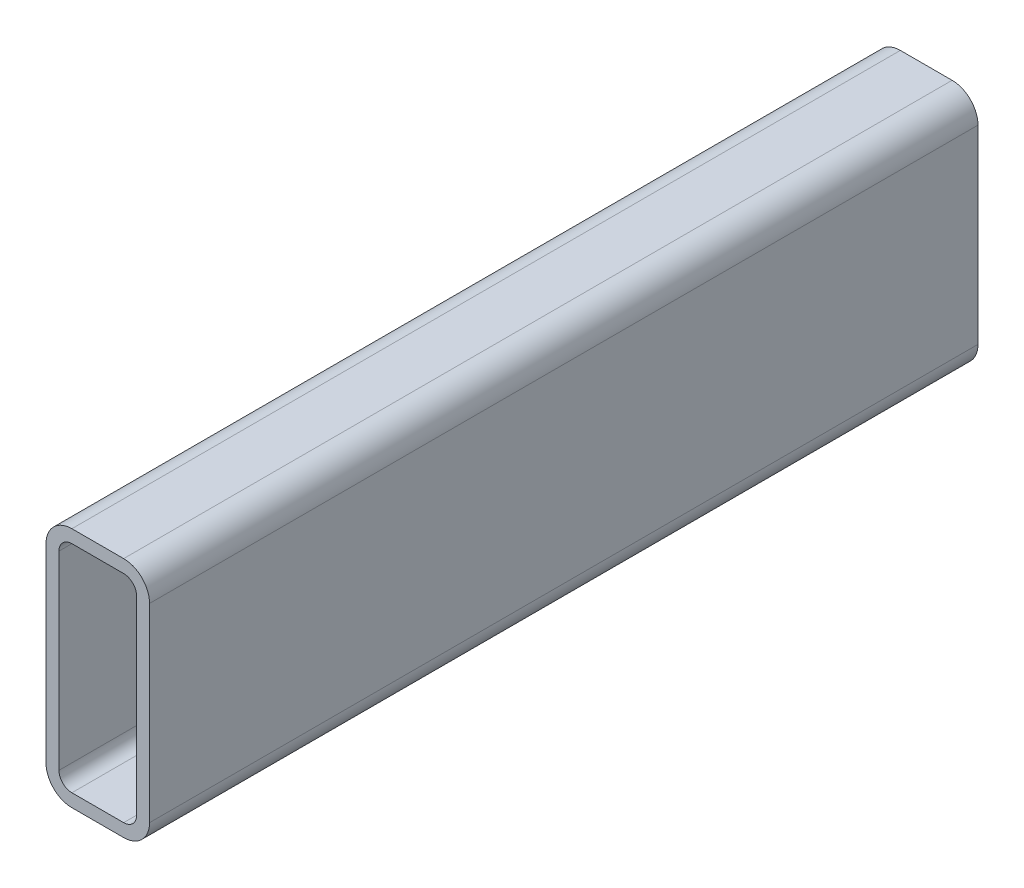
ISO-10303-21;
HEADER;
FILE_DESCRIPTION(('STEP AP214'),'2;1');
FILE_NAME('part.step','',(''),(''),'','','');
FILE_SCHEMA(('AUTOMOTIVE_DESIGN { 1 0 10303 214 1 1 1 1 }'));
ENDSEC;
DATA;
#1=APPLICATION_CONTEXT('core data for automotive mechanical design processes');
#2=APPLICATION_PROTOCOL_DEFINITION('international standard','automotive_design',2000,#1);
#3=PRODUCT_CONTEXT('',#1,'mechanical');
#4=PRODUCT('Part','Part','',(#3));
#5=PRODUCT_RELATED_PRODUCT_CATEGORY('part','',(#4));
#6=PRODUCT_DEFINITION_FORMATION('','',#4);
#7=PRODUCT_DEFINITION_CONTEXT('part definition',#1,'design');
#8=PRODUCT_DEFINITION('design','',#6,#7);
#9=PRODUCT_DEFINITION_SHAPE('','',#8);
#10=(LENGTH_UNIT() NAMED_UNIT(*) SI_UNIT(.MILLI.,.METRE.));
#11=(NAMED_UNIT(*) PLANE_ANGLE_UNIT() SI_UNIT($,.RADIAN.));
#12=(NAMED_UNIT(*) SI_UNIT($,.STERADIAN.) SOLID_ANGLE_UNIT());
#13=UNCERTAINTY_MEASURE_WITH_UNIT(LENGTH_MEASURE(1.E-05),#10,'distance_accuracy_value','');
#14=(GEOMETRIC_REPRESENTATION_CONTEXT(3) GLOBAL_UNCERTAINTY_ASSIGNED_CONTEXT((#13)) GLOBAL_UNIT_ASSIGNED_CONTEXT((#10,
#11,#12)) REPRESENTATION_CONTEXT('',''));
#15=CARTESIAN_POINT('',(0.,0.,0.));
#16=DIRECTION('',(0.,0.,1.));
#17=DIRECTION('',(1.,0.,0.));
#18=AXIS2_PLACEMENT_3D('',#15,#16,#17);
#19=CARTESIAN_POINT('',(9.525,79.375,304.8));
#20=DIRECTION('',(0.,0.,1.));
#21=DIRECTION('',(1.,0.,0.));
#22=AXIS2_PLACEMENT_3D('',#19,#20,#21);
#23=PLANE('',#22);
#24=CARTESIAN_POINT('',(9.525,79.375,304.8));
#25=DIRECTION('',(0.,0.,1.));
#26=DIRECTION('',(1.,0.,0.));
#27=AXIS2_PLACEMENT_3D('',#24,#25,#26);
#28=CIRCLE('',#27,9.525);
#29=CARTESIAN_POINT('',(9.525,88.9,304.8));
#30=VERTEX_POINT('',#29);
#31=CARTESIAN_POINT('',(0.,79.375,304.8));
#32=VERTEX_POINT('',#31);
#33=EDGE_CURVE('E211',#30,#32,#28,.T.);
#34=ORIENTED_EDGE('',*,*,#33,.T.);
#35=DIRECTION('',(0.,-1.,0.));
#36=VECTOR('',#35,1.);
#37=CARTESIAN_POINT('',(0.,79.375,304.8));
#38=LINE('',#37,#36);
#39=CARTESIAN_POINT('',(0.,9.525,304.8));
#40=VERTEX_POINT('',#39);
#41=EDGE_CURVE('E214',#32,#40,#38,.T.);
#42=ORIENTED_EDGE('',*,*,#41,.T.);
#43=CARTESIAN_POINT('',(9.525,9.525,304.8));
#44=DIRECTION('',(0.,0.,1.));
#45=DIRECTION('',(1.,0.,0.));
#46=AXIS2_PLACEMENT_3D('',#43,#44,#45);
#47=CIRCLE('',#46,9.525);
#48=CARTESIAN_POINT('',(9.525,0.,304.8));
#49=VERTEX_POINT('',#48);
#50=EDGE_CURVE('E217',#40,#49,#47,.T.);
#51=ORIENTED_EDGE('',*,*,#50,.T.);
#52=DIRECTION('',(1.,0.,0.));
#53=VECTOR('',#52,1.);
#54=CARTESIAN_POINT('',(9.525,0.,304.8));
#55=LINE('',#54,#53);
#56=CARTESIAN_POINT('',(28.575,0.,304.8));
#57=VERTEX_POINT('',#56);
#58=EDGE_CURVE('E219',#49,#57,#55,.T.);
#59=ORIENTED_EDGE('',*,*,#58,.T.);
#60=CARTESIAN_POINT('',(28.575,9.525,304.8));
#61=DIRECTION('',(0.,0.,1.));
#62=DIRECTION('',(1.,0.,0.));
#63=AXIS2_PLACEMENT_3D('',#60,#61,#62);
#64=CIRCLE('',#63,9.525);
#65=CARTESIAN_POINT('',(38.1,9.525,304.8));
#66=VERTEX_POINT('',#65);
#67=EDGE_CURVE('E221',#57,#66,#64,.T.);
#68=ORIENTED_EDGE('',*,*,#67,.T.);
#69=DIRECTION('',(0.,1.,0.));
#70=VECTOR('',#69,1.);
#71=CARTESIAN_POINT('',(38.1,9.525,304.8));
#72=LINE('',#71,#70);
#73=CARTESIAN_POINT('',(38.1,79.375,304.8));
#74=VERTEX_POINT('',#73);
#75=EDGE_CURVE('E223',#66,#74,#72,.T.);
#76=ORIENTED_EDGE('',*,*,#75,.T.);
#77=CARTESIAN_POINT('',(28.575,79.375,304.8));
#78=DIRECTION('',(0.,0.,1.));
#79=DIRECTION('',(1.,0.,0.));
#80=AXIS2_PLACEMENT_3D('',#77,#78,#79);
#81=CIRCLE('',#80,9.525);
#82=CARTESIAN_POINT('',(28.575,88.9,304.8));
#83=VERTEX_POINT('',#82);
#84=EDGE_CURVE('E225',#74,#83,#81,.T.);
#85=ORIENTED_EDGE('',*,*,#84,.T.);
#86=DIRECTION('',(-1.,0.,0.));
#87=VECTOR('',#86,1.);
#88=CARTESIAN_POINT('',(28.575,88.9,304.8));
#89=LINE('',#88,#87);
#90=EDGE_CURVE('E227',#83,#30,#89,.T.);
#91=ORIENTED_EDGE('',*,*,#90,.T.);
#92=EDGE_LOOP('',(#34,#42,#51,#59,#68,#76,#85,#91));
#93=FACE_BOUND('',#92,.T.);
#94=DIRECTION('',(0.,-1.,0.));
#95=VECTOR('',#94,1.);
#96=CARTESIAN_POINT('',(4.7625,9.525,304.8));
#97=LINE('',#96,#95);
#98=CARTESIAN_POINT('',(4.7625,79.375,304.8));
#99=VERTEX_POINT('',#98);
#100=CARTESIAN_POINT('',(4.7625,9.525,304.8));
#101=VERTEX_POINT('',#100);
#102=EDGE_CURVE('E154',#99,#101,#97,.T.);
#103=ORIENTED_EDGE('',*,*,#102,.F.);
#104=CARTESIAN_POINT('',(9.525,79.375,304.8));
#105=DIRECTION('',(0.,0.,1.));
#106=DIRECTION('',(1.,0.,0.));
#107=AXIS2_PLACEMENT_3D('',#104,#105,#106);
#108=CIRCLE('',#107,4.76249999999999);
#109=CARTESIAN_POINT('',(9.525,84.1375,304.8));
#110=VERTEX_POINT('',#109);
#111=EDGE_CURVE('E146',#110,#99,#108,.T.);
#112=ORIENTED_EDGE('',*,*,#111,.F.);
#113=DIRECTION('',(-1.,0.,0.));
#114=VECTOR('',#113,1.);
#115=CARTESIAN_POINT('',(9.525,84.1375,304.8));
#116=LINE('',#115,#114);
#117=CARTESIAN_POINT('',(28.575,84.1375,304.8));
#118=VERTEX_POINT('',#117);
#119=EDGE_CURVE('E179',#118,#110,#116,.T.);
#120=ORIENTED_EDGE('',*,*,#119,.F.);
#121=CARTESIAN_POINT('',(28.575,79.375,304.8));
#122=DIRECTION('',(0.,0.,1.));
#123=DIRECTION('',(1.,0.,0.));
#124=AXIS2_PLACEMENT_3D('',#121,#122,#123);
#125=CIRCLE('',#124,4.76249999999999);
#126=CARTESIAN_POINT('',(33.3375,79.375,304.8));
#127=VERTEX_POINT('',#126);
#128=EDGE_CURVE('E177',#127,#118,#125,.T.);
#129=ORIENTED_EDGE('',*,*,#128,.F.);
#130=DIRECTION('',(0.,1.,0.));
#131=VECTOR('',#130,1.);
#132=CARTESIAN_POINT('',(33.3375,79.375,304.8));
#133=LINE('',#132,#131);
#134=CARTESIAN_POINT('',(33.3375,9.525,304.8));
#135=VERTEX_POINT('',#134);
#136=EDGE_CURVE('E175',#135,#127,#133,.T.);
#137=ORIENTED_EDGE('',*,*,#136,.F.);
#138=CARTESIAN_POINT('',(28.575,9.525,304.8));
#139=DIRECTION('',(0.,0.,1.));
#140=DIRECTION('',(1.,0.,0.));
#141=AXIS2_PLACEMENT_3D('',#138,#139,#140);
#142=CIRCLE('',#141,4.7625);
#143=CARTESIAN_POINT('',(28.575,4.7625,304.8));
#144=VERTEX_POINT('',#143);
#145=EDGE_CURVE('E173',#144,#135,#142,.T.);
#146=ORIENTED_EDGE('',*,*,#145,.F.);
#147=DIRECTION('',(1.,0.,0.));
#148=VECTOR('',#147,1.);
#149=CARTESIAN_POINT('',(28.575,4.7625,304.8));
#150=LINE('',#149,#148);
#151=CARTESIAN_POINT('',(9.525,4.7625,304.8));
#152=VERTEX_POINT('',#151);
#153=EDGE_CURVE('E169',#152,#144,#150,.T.);
#154=ORIENTED_EDGE('',*,*,#153,.F.);
#155=CARTESIAN_POINT('',(9.525,9.525,304.8));
#156=DIRECTION('',(0.,0.,1.));
#157=DIRECTION('',(1.,0.,0.));
#158=AXIS2_PLACEMENT_3D('',#155,#156,#157);
#159=CIRCLE('',#158,4.7625);
#160=EDGE_CURVE('E167',#101,#152,#159,.T.);
#161=ORIENTED_EDGE('',*,*,#160,.F.);
#162=EDGE_LOOP('',(#103,#112,#120,#129,#137,#146,#154,#161));
#163=FACE_BOUND('',#162,.T.);
#164=ADVANCED_FACE('F33',(#93,#163),#23,.T.);
#165=CARTESIAN_POINT('',(9.525,79.375,0.));
#166=DIRECTION('',(0.,0.,1.));
#167=DIRECTION('',(1.,0.,0.));
#168=AXIS2_PLACEMENT_3D('',#165,#166,#167);
#169=PLANE('',#168);
#170=CARTESIAN_POINT('',(9.525,79.375,0.));
#171=DIRECTION('',(0.,0.,1.));
#172=DIRECTION('',(1.,0.,0.));
#173=AXIS2_PLACEMENT_3D('',#170,#171,#172);
#174=CIRCLE('',#173,9.525);
#175=CARTESIAN_POINT('',(9.525,88.9,0.));
#176=VERTEX_POINT('',#175);
#177=CARTESIAN_POINT('',(0.,79.375,0.));
#178=VERTEX_POINT('',#177);
#179=EDGE_CURVE('E162',#176,#178,#174,.T.);
#180=ORIENTED_EDGE('',*,*,#179,.F.);
#181=DIRECTION('',(-1.,0.,0.));
#182=VECTOR('',#181,1.);
#183=CARTESIAN_POINT('',(28.575,88.9,0.));
#184=LINE('',#183,#182);
#185=CARTESIAN_POINT('',(28.575,88.9,0.));
#186=VERTEX_POINT('',#185);
#187=EDGE_CURVE('E215',#186,#176,#184,.T.);
#188=ORIENTED_EDGE('',*,*,#187,.F.);
#189=CARTESIAN_POINT('',(28.575,79.375,0.));
#190=DIRECTION('',(0.,0.,1.));
#191=DIRECTION('',(1.,0.,0.));
#192=AXIS2_PLACEMENT_3D('',#189,#190,#191);
#193=CIRCLE('',#192,9.525);
#194=CARTESIAN_POINT('',(38.1,79.375,0.));
#195=VERTEX_POINT('',#194);
#196=EDGE_CURVE('E242',#195,#186,#193,.T.);
#197=ORIENTED_EDGE('',*,*,#196,.F.);
#198=DIRECTION('',(0.,1.,0.));
#199=VECTOR('',#198,1.);
#200=CARTESIAN_POINT('',(38.1,9.525,0.));
#201=LINE('',#200,#199);
#202=CARTESIAN_POINT('',(38.1,9.525,0.));
#203=VERTEX_POINT('',#202);
#204=EDGE_CURVE('E240',#203,#195,#201,.T.);
#205=ORIENTED_EDGE('',*,*,#204,.F.);
#206=CARTESIAN_POINT('',(28.575,9.525,0.));
#207=DIRECTION('',(0.,0.,1.));
#208=DIRECTION('',(1.,0.,0.));
#209=AXIS2_PLACEMENT_3D('',#206,#207,#208);
#210=CIRCLE('',#209,9.525);
#211=CARTESIAN_POINT('',(28.575,0.,0.));
#212=VERTEX_POINT('',#211);
#213=EDGE_CURVE('E238',#212,#203,#210,.T.);
#214=ORIENTED_EDGE('',*,*,#213,.F.);
#215=DIRECTION('',(1.,0.,0.));
#216=VECTOR('',#215,1.);
#217=CARTESIAN_POINT('',(9.525,0.,0.));
#218=LINE('',#217,#216);
#219=CARTESIAN_POINT('',(9.525,0.,0.));
#220=VERTEX_POINT('',#219);
#221=EDGE_CURVE('E236',#220,#212,#218,.T.);
#222=ORIENTED_EDGE('',*,*,#221,.F.);
#223=CARTESIAN_POINT('',(9.525,9.525,0.));
#224=DIRECTION('',(0.,0.,1.));
#225=DIRECTION('',(1.,0.,0.));
#226=AXIS2_PLACEMENT_3D('',#223,#224,#225);
#227=CIRCLE('',#226,9.525);
#228=CARTESIAN_POINT('',(0.,9.525,0.));
#229=VERTEX_POINT('',#228);
#230=EDGE_CURVE('E234',#229,#220,#227,.T.);
#231=ORIENTED_EDGE('',*,*,#230,.F.);
#232=DIRECTION('',(0.,-1.,0.));
#233=VECTOR('',#232,1.);
#234=CARTESIAN_POINT('',(0.,79.375,0.));
#235=LINE('',#234,#233);
#236=EDGE_CURVE('E232',#178,#229,#235,.T.);
#237=ORIENTED_EDGE('',*,*,#236,.F.);
#238=EDGE_LOOP('',(#180,#188,#197,#205,#214,#222,#231,#237));
#239=FACE_BOUND('',#238,.T.);
#240=CARTESIAN_POINT('',(9.525,79.375,0.));
#241=DIRECTION('',(0.,0.,1.));
#242=DIRECTION('',(1.,0.,0.));
#243=AXIS2_PLACEMENT_3D('',#240,#241,#242);
#244=CIRCLE('',#243,4.76249999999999);
#245=CARTESIAN_POINT('',(9.525,84.1375,0.));
#246=VERTEX_POINT('',#245);
#247=CARTESIAN_POINT('',(4.7625,79.375,0.));
#248=VERTEX_POINT('',#247);
#249=EDGE_CURVE('E56',#246,#248,#244,.T.);
#250=ORIENTED_EDGE('',*,*,#249,.T.);
#251=DIRECTION('',(0.,-1.,0.));
#252=VECTOR('',#251,1.);
#253=CARTESIAN_POINT('',(4.7625,9.525,0.));
#254=LINE('',#253,#252);
#255=CARTESIAN_POINT('',(4.7625,9.525,0.));
#256=VERTEX_POINT('',#255);
#257=EDGE_CURVE('E161',#248,#256,#254,.T.);
#258=ORIENTED_EDGE('',*,*,#257,.T.);
#259=CARTESIAN_POINT('',(9.525,9.525,0.));
#260=DIRECTION('',(0.,0.,1.));
#261=DIRECTION('',(1.,0.,0.));
#262=AXIS2_PLACEMENT_3D('',#259,#260,#261);
#263=CIRCLE('',#262,4.7625);
#264=CARTESIAN_POINT('',(9.525,4.7625,0.));
#265=VERTEX_POINT('',#264);
#266=EDGE_CURVE('E183',#256,#265,#263,.T.);
#267=ORIENTED_EDGE('',*,*,#266,.T.);
#268=DIRECTION('',(1.,0.,0.));
#269=VECTOR('',#268,1.);
#270=CARTESIAN_POINT('',(28.575,4.7625,0.));
#271=LINE('',#270,#269);
#272=CARTESIAN_POINT('',(28.575,4.7625,0.));
#273=VERTEX_POINT('',#272);
#274=EDGE_CURVE('E186',#265,#273,#271,.T.);
#275=ORIENTED_EDGE('',*,*,#274,.T.);
#276=CARTESIAN_POINT('',(28.575,9.525,0.));
#277=DIRECTION('',(0.,0.,1.));
#278=DIRECTION('',(1.,0.,0.));
#279=AXIS2_PLACEMENT_3D('',#276,#277,#278);
#280=CIRCLE('',#279,4.7625);
#281=CARTESIAN_POINT('',(33.3375,9.525,0.));
#282=VERTEX_POINT('',#281);
#283=EDGE_CURVE('E189',#273,#282,#280,.T.);
#284=ORIENTED_EDGE('',*,*,#283,.T.);
#285=DIRECTION('',(0.,1.,0.));
#286=VECTOR('',#285,1.);
#287=CARTESIAN_POINT('',(33.3375,79.375,0.));
#288=LINE('',#287,#286);
#289=CARTESIAN_POINT('',(33.3375,79.375,0.));
#290=VERTEX_POINT('',#289);
#291=EDGE_CURVE('E192',#282,#290,#288,.T.);
#292=ORIENTED_EDGE('',*,*,#291,.T.);
#293=CARTESIAN_POINT('',(28.575,79.375,0.));
#294=DIRECTION('',(0.,0.,1.));
#295=DIRECTION('',(1.,0.,0.));
#296=AXIS2_PLACEMENT_3D('',#293,#294,#295);
#297=CIRCLE('',#296,4.76249999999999);
#298=CARTESIAN_POINT('',(28.575,84.1375,0.));
#299=VERTEX_POINT('',#298);
#300=EDGE_CURVE('E195',#290,#299,#297,.T.);
#301=ORIENTED_EDGE('',*,*,#300,.T.);
#302=DIRECTION('',(-1.,0.,0.));
#303=VECTOR('',#302,1.);
#304=CARTESIAN_POINT('',(9.525,84.1375,0.));
#305=LINE('',#304,#303);
#306=EDGE_CURVE('E155',#299,#246,#305,.T.);
#307=ORIENTED_EDGE('',*,*,#306,.T.);
#308=EDGE_LOOP('',(#250,#258,#267,#275,#284,#292,#301,#307));
#309=FACE_BOUND('',#308,.T.);
#310=ADVANCED_FACE('F272',(#239,#309),#169,.F.);
#311=CARTESIAN_POINT('',(9.525,79.375,304.8));
#312=DIRECTION('',(0.,0.,-1.));
#313=DIRECTION('',(-1.,0.,0.));
#314=AXIS2_PLACEMENT_3D('',#311,#312,#313);
#315=CYLINDRICAL_SURFACE('',#314,9.525);
#316=ORIENTED_EDGE('',*,*,#179,.T.);
#317=DIRECTION('',(0.,0.,-1.));
#318=VECTOR('',#317,1.);
#319=CARTESIAN_POINT('',(0.,79.375,304.8));
#320=LINE('',#319,#318);
#321=EDGE_CURVE('E11',#32,#178,#320,.T.);
#322=ORIENTED_EDGE('',*,*,#321,.F.);
#323=ORIENTED_EDGE('',*,*,#33,.F.);
#324=DIRECTION('',(0.,0.,-1.));
#325=VECTOR('',#324,1.);
#326=CARTESIAN_POINT('',(9.525,88.9,304.8));
#327=LINE('',#326,#325);
#328=EDGE_CURVE('E229',#30,#176,#327,.T.);
#329=ORIENTED_EDGE('',*,*,#328,.T.);
#330=EDGE_LOOP('',(#316,#322,#323,#329));
#331=FACE_BOUND('',#330,.T.);
#332=ADVANCED_FACE('F35',(#331),#315,.T.);
#333=CARTESIAN_POINT('',(0.,79.375,304.8));
#334=DIRECTION('',(1.,0.,0.));
#335=DIRECTION('',(0.,0.,-1.));
#336=AXIS2_PLACEMENT_3D('',#333,#334,#335);
#337=PLANE('',#336);
#338=ORIENTED_EDGE('',*,*,#236,.T.);
#339=DIRECTION('',(0.,0.,-1.));
#340=VECTOR('',#339,1.);
#341=CARTESIAN_POINT('',(0.,9.525,304.8));
#342=LINE('',#341,#340);
#343=EDGE_CURVE('E41',#40,#229,#342,.T.);
#344=ORIENTED_EDGE('',*,*,#343,.F.);
#345=ORIENTED_EDGE('',*,*,#41,.F.);
#346=ORIENTED_EDGE('',*,*,#321,.T.);
#347=EDGE_LOOP('',(#338,#344,#345,#346));
#348=FACE_BOUND('',#347,.T.);
#349=ADVANCED_FACE('F289',(#348),#337,.F.);
#350=CARTESIAN_POINT('',(9.525,9.525,304.8));
#351=DIRECTION('',(0.,0.,-1.));
#352=DIRECTION('',(-1.,0.,0.));
#353=AXIS2_PLACEMENT_3D('',#350,#351,#352);
#354=CYLINDRICAL_SURFACE('',#353,9.525);
#355=ORIENTED_EDGE('',*,*,#230,.T.);
#356=DIRECTION('',(0.,0.,-1.));
#357=VECTOR('',#356,1.);
#358=CARTESIAN_POINT('',(9.525,0.,304.8));
#359=LINE('',#358,#357);
#360=EDGE_CURVE('E259',#49,#220,#359,.T.);
#361=ORIENTED_EDGE('',*,*,#360,.F.);
#362=ORIENTED_EDGE('',*,*,#50,.F.);
#363=ORIENTED_EDGE('',*,*,#343,.T.);
#364=EDGE_LOOP('',(#355,#361,#362,#363));
#365=FACE_BOUND('',#364,.T.);
#366=ADVANCED_FACE('F266',(#365),#354,.T.);
#367=CARTESIAN_POINT('',(9.525,0.,304.8));
#368=DIRECTION('',(0.,1.,0.));
#369=DIRECTION('',(0.,0.,1.));
#370=AXIS2_PLACEMENT_3D('',#367,#368,#369);
#371=PLANE('',#370);
#372=ORIENTED_EDGE('',*,*,#221,.T.);
#373=DIRECTION('',(0.,0.,-1.));
#374=VECTOR('',#373,1.);
#375=CARTESIAN_POINT('',(28.575,0.,304.8));
#376=LINE('',#375,#374);
#377=EDGE_CURVE('E256',#57,#212,#376,.T.);
#378=ORIENTED_EDGE('',*,*,#377,.F.);
#379=ORIENTED_EDGE('',*,*,#58,.F.);
#380=ORIENTED_EDGE('',*,*,#360,.T.);
#381=EDGE_LOOP('',(#372,#378,#379,#380));
#382=FACE_BOUND('',#381,.T.);
#383=ADVANCED_FACE('F278',(#382),#371,.F.);
#384=CARTESIAN_POINT('',(28.575,9.525,304.8));
#385=DIRECTION('',(0.,0.,-1.));
#386=DIRECTION('',(-1.,0.,0.));
#387=AXIS2_PLACEMENT_3D('',#384,#385,#386);
#388=CYLINDRICAL_SURFACE('',#387,9.525);
#389=ORIENTED_EDGE('',*,*,#213,.T.);
#390=DIRECTION('',(0.,0.,-1.));
#391=VECTOR('',#390,1.);
#392=CARTESIAN_POINT('',(38.1,9.525,304.8));
#393=LINE('',#392,#391);
#394=EDGE_CURVE('E253',#66,#203,#393,.T.);
#395=ORIENTED_EDGE('',*,*,#394,.F.);
#396=ORIENTED_EDGE('',*,*,#67,.F.);
#397=ORIENTED_EDGE('',*,*,#377,.T.);
#398=EDGE_LOOP('',(#389,#395,#396,#397));
#399=FACE_BOUND('',#398,.T.);
#400=ADVANCED_FACE('F282',(#399),#388,.T.);
#401=CARTESIAN_POINT('',(38.1,9.525,304.8));
#402=DIRECTION('',(-1.,0.,0.));
#403=DIRECTION('',(0.,0.,1.));
#404=AXIS2_PLACEMENT_3D('',#401,#402,#403);
#405=PLANE('',#404);
#406=ORIENTED_EDGE('',*,*,#204,.T.);
#407=DIRECTION('',(0.,0.,-1.));
#408=VECTOR('',#407,1.);
#409=CARTESIAN_POINT('',(38.1,79.375,304.8));
#410=LINE('',#409,#408);
#411=EDGE_CURVE('E250',#74,#195,#410,.T.);
#412=ORIENTED_EDGE('',*,*,#411,.F.);
#413=ORIENTED_EDGE('',*,*,#75,.F.);
#414=ORIENTED_EDGE('',*,*,#394,.T.);
#415=EDGE_LOOP('',(#406,#412,#413,#414));
#416=FACE_BOUND('',#415,.T.);
#417=ADVANCED_FACE('F302',(#416),#405,.F.);
#418=CARTESIAN_POINT('',(28.575,79.375,304.8));
#419=DIRECTION('',(0.,0.,-1.));
#420=DIRECTION('',(-1.,0.,0.));
#421=AXIS2_PLACEMENT_3D('',#418,#419,#420);
#422=CYLINDRICAL_SURFACE('',#421,9.525);
#423=ORIENTED_EDGE('',*,*,#196,.T.);
#424=DIRECTION('',(0.,0.,-1.));
#425=VECTOR('',#424,1.);
#426=CARTESIAN_POINT('',(28.575,88.9,304.8));
#427=LINE('',#426,#425);
#428=EDGE_CURVE('E247',#83,#186,#427,.T.);
#429=ORIENTED_EDGE('',*,*,#428,.F.);
#430=ORIENTED_EDGE('',*,*,#84,.F.);
#431=ORIENTED_EDGE('',*,*,#411,.T.);
#432=EDGE_LOOP('',(#423,#429,#430,#431));
#433=FACE_BOUND('',#432,.T.);
#434=ADVANCED_FACE('F300',(#433),#422,.T.);
#435=CARTESIAN_POINT('',(28.575,88.9,304.8));
#436=DIRECTION('',(0.,-1.,0.));
#437=DIRECTION('',(0.,0.,-1.));
#438=AXIS2_PLACEMENT_3D('',#435,#436,#437);
#439=PLANE('',#438);
#440=ORIENTED_EDGE('',*,*,#187,.T.);
#441=ORIENTED_EDGE('',*,*,#328,.F.);
#442=ORIENTED_EDGE('',*,*,#90,.F.);
#443=ORIENTED_EDGE('',*,*,#428,.T.);
#444=EDGE_LOOP('',(#440,#441,#442,#443));
#445=FACE_BOUND('',#444,.T.);
#446=ADVANCED_FACE('F295',(#445),#439,.F.);
#447=CARTESIAN_POINT('',(9.525,79.375,304.8));
#448=DIRECTION('',(0.,0.,-1.));
#449=DIRECTION('',(-1.,0.,0.));
#450=AXIS2_PLACEMENT_3D('',#447,#448,#449);
#451=CYLINDRICAL_SURFACE('',#450,4.76249999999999);
#452=ORIENTED_EDGE('',*,*,#249,.F.);
#453=DIRECTION('',(0.,0.,-1.));
#454=VECTOR('',#453,1.);
#455=CARTESIAN_POINT('',(9.525,84.1375,304.8));
#456=LINE('',#455,#454);
#457=EDGE_CURVE('E150',#110,#246,#456,.T.);
#458=ORIENTED_EDGE('',*,*,#457,.F.);
#459=ORIENTED_EDGE('',*,*,#111,.T.);
#460=DIRECTION('',(0.,0.,-1.));
#461=VECTOR('',#460,1.);
#462=CARTESIAN_POINT('',(4.7625,79.375,304.8));
#463=LINE('',#462,#461);
#464=EDGE_CURVE('E149',#99,#248,#463,.T.);
#465=ORIENTED_EDGE('',*,*,#464,.T.);
#466=EDGE_LOOP('',(#452,#458,#459,#465));
#467=FACE_BOUND('',#466,.T.);
#468=ADVANCED_FACE('F148',(#467),#451,.F.);
#469=CARTESIAN_POINT('',(4.7625,9.525,304.8));
#470=DIRECTION('',(1.,0.,0.));
#471=DIRECTION('',(0.,0.,-1.));
#472=AXIS2_PLACEMENT_3D('',#469,#470,#471);
#473=PLANE('',#472);
#474=ORIENTED_EDGE('',*,*,#257,.F.);
#475=ORIENTED_EDGE('',*,*,#464,.F.);
#476=ORIENTED_EDGE('',*,*,#102,.T.);
#477=DIRECTION('',(0.,0.,-1.));
#478=VECTOR('',#477,1.);
#479=CARTESIAN_POINT('',(4.7625,9.525,304.8));
#480=LINE('',#479,#478);
#481=EDGE_CURVE('E163',#101,#256,#480,.T.);
#482=ORIENTED_EDGE('',*,*,#481,.T.);
#483=EDGE_LOOP('',(#474,#475,#476,#482));
#484=FACE_BOUND('',#483,.T.);
#485=ADVANCED_FACE('F158',(#484),#473,.T.);
#486=CARTESIAN_POINT('',(9.525,9.525,304.8));
#487=DIRECTION('',(0.,0.,-1.));
#488=DIRECTION('',(-1.,0.,0.));
#489=AXIS2_PLACEMENT_3D('',#486,#487,#488);
#490=CYLINDRICAL_SURFACE('',#489,4.7625);
#491=ORIENTED_EDGE('',*,*,#266,.F.);
#492=ORIENTED_EDGE('',*,*,#481,.F.);
#493=ORIENTED_EDGE('',*,*,#160,.T.);
#494=DIRECTION('',(0.,0.,-1.));
#495=VECTOR('',#494,1.);
#496=CARTESIAN_POINT('',(9.525,4.7625,304.8));
#497=LINE('',#496,#495);
#498=EDGE_CURVE('E208',#152,#265,#497,.T.);
#499=ORIENTED_EDGE('',*,*,#498,.T.);
#500=EDGE_LOOP('',(#491,#492,#493,#499));
#501=FACE_BOUND('',#500,.T.);
#502=ADVANCED_FACE('F327',(#501),#490,.F.);
#503=CARTESIAN_POINT('',(28.575,4.7625,304.8));
#504=DIRECTION('',(0.,1.,0.));
#505=DIRECTION('',(0.,0.,1.));
#506=AXIS2_PLACEMENT_3D('',#503,#504,#505);
#507=PLANE('',#506);
#508=ORIENTED_EDGE('',*,*,#274,.F.);
#509=ORIENTED_EDGE('',*,*,#498,.F.);
#510=ORIENTED_EDGE('',*,*,#153,.T.);
#511=DIRECTION('',(0.,0.,-1.));
#512=VECTOR('',#511,1.);
#513=CARTESIAN_POINT('',(28.575,4.7625,304.8));
#514=LINE('',#513,#512);
#515=EDGE_CURVE('E206',#144,#273,#514,.T.);
#516=ORIENTED_EDGE('',*,*,#515,.T.);
#517=EDGE_LOOP('',(#508,#509,#510,#516));
#518=FACE_BOUND('',#517,.T.);
#519=ADVANCED_FACE('F331',(#518),#507,.T.);
#520=CARTESIAN_POINT('',(28.575,9.525,304.8));
#521=DIRECTION('',(0.,0.,-1.));
#522=DIRECTION('',(-1.,0.,0.));
#523=AXIS2_PLACEMENT_3D('',#520,#521,#522);
#524=CYLINDRICAL_SURFACE('',#523,4.7625);
#525=ORIENTED_EDGE('',*,*,#283,.F.);
#526=ORIENTED_EDGE('',*,*,#515,.F.);
#527=ORIENTED_EDGE('',*,*,#145,.T.);
#528=DIRECTION('',(0.,0.,-1.));
#529=VECTOR('',#528,1.);
#530=CARTESIAN_POINT('',(33.3375,9.525,304.8));
#531=LINE('',#530,#529);
#532=EDGE_CURVE('E204',#135,#282,#531,.T.);
#533=ORIENTED_EDGE('',*,*,#532,.T.);
#534=EDGE_LOOP('',(#525,#526,#527,#533));
#535=FACE_BOUND('',#534,.T.);
#536=ADVANCED_FACE('F337',(#535),#524,.F.);
#537=CARTESIAN_POINT('',(33.3375,79.375,304.8));
#538=DIRECTION('',(-1.,0.,0.));
#539=DIRECTION('',(0.,0.,1.));
#540=AXIS2_PLACEMENT_3D('',#537,#538,#539);
#541=PLANE('',#540);
#542=ORIENTED_EDGE('',*,*,#291,.F.);
#543=ORIENTED_EDGE('',*,*,#532,.F.);
#544=ORIENTED_EDGE('',*,*,#136,.T.);
#545=DIRECTION('',(0.,0.,-1.));
#546=VECTOR('',#545,1.);
#547=CARTESIAN_POINT('',(33.3375,79.375,304.8));
#548=LINE('',#547,#546);
#549=EDGE_CURVE('E202',#127,#290,#548,.T.);
#550=ORIENTED_EDGE('',*,*,#549,.T.);
#551=EDGE_LOOP('',(#542,#543,#544,#550));
#552=FACE_BOUND('',#551,.T.);
#553=ADVANCED_FACE('F341',(#552),#541,.T.);
#554=CARTESIAN_POINT('',(28.575,79.375,304.8));
#555=DIRECTION('',(0.,0.,-1.));
#556=DIRECTION('',(-1.,0.,0.));
#557=AXIS2_PLACEMENT_3D('',#554,#555,#556);
#558=CYLINDRICAL_SURFACE('',#557,4.76249999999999);
#559=ORIENTED_EDGE('',*,*,#300,.F.);
#560=ORIENTED_EDGE('',*,*,#549,.F.);
#561=ORIENTED_EDGE('',*,*,#128,.T.);
#562=DIRECTION('',(0.,0.,-1.));
#563=VECTOR('',#562,1.);
#564=CARTESIAN_POINT('',(28.575,84.1375,304.8));
#565=LINE('',#564,#563);
#566=EDGE_CURVE('E48',#118,#299,#565,.T.);
#567=ORIENTED_EDGE('',*,*,#566,.T.);
#568=EDGE_LOOP('',(#559,#560,#561,#567));
#569=FACE_BOUND('',#568,.T.);
#570=ADVANCED_FACE('F345',(#569),#558,.F.);
#571=CARTESIAN_POINT('',(9.525,84.1375,304.8));
#572=DIRECTION('',(0.,-1.,0.));
#573=DIRECTION('',(0.,0.,-1.));
#574=AXIS2_PLACEMENT_3D('',#571,#572,#573);
#575=PLANE('',#574);
#576=ORIENTED_EDGE('',*,*,#306,.F.);
#577=ORIENTED_EDGE('',*,*,#566,.F.);
#578=ORIENTED_EDGE('',*,*,#119,.T.);
#579=ORIENTED_EDGE('',*,*,#457,.T.);
#580=EDGE_LOOP('',(#576,#577,#578,#579));
#581=FACE_BOUND('',#580,.T.);
#582=ADVANCED_FACE('F349',(#581),#575,.T.);
#583=CLOSED_SHELL('',(#164,#310,#332,#349,#366,#383,#400,#417,#434,#446,#468,#485,#502,#519,
#536,#553,#570,#582));
#584=MANIFOLD_SOLID_BREP('B2',#583);
#585=ADVANCED_BREP_SHAPE_REPRESENTATION('',(#18,#584),#14);
#586=SHAPE_DEFINITION_REPRESENTATION(#9,#585);
ENDSEC;
END-ISO-10303-21;
